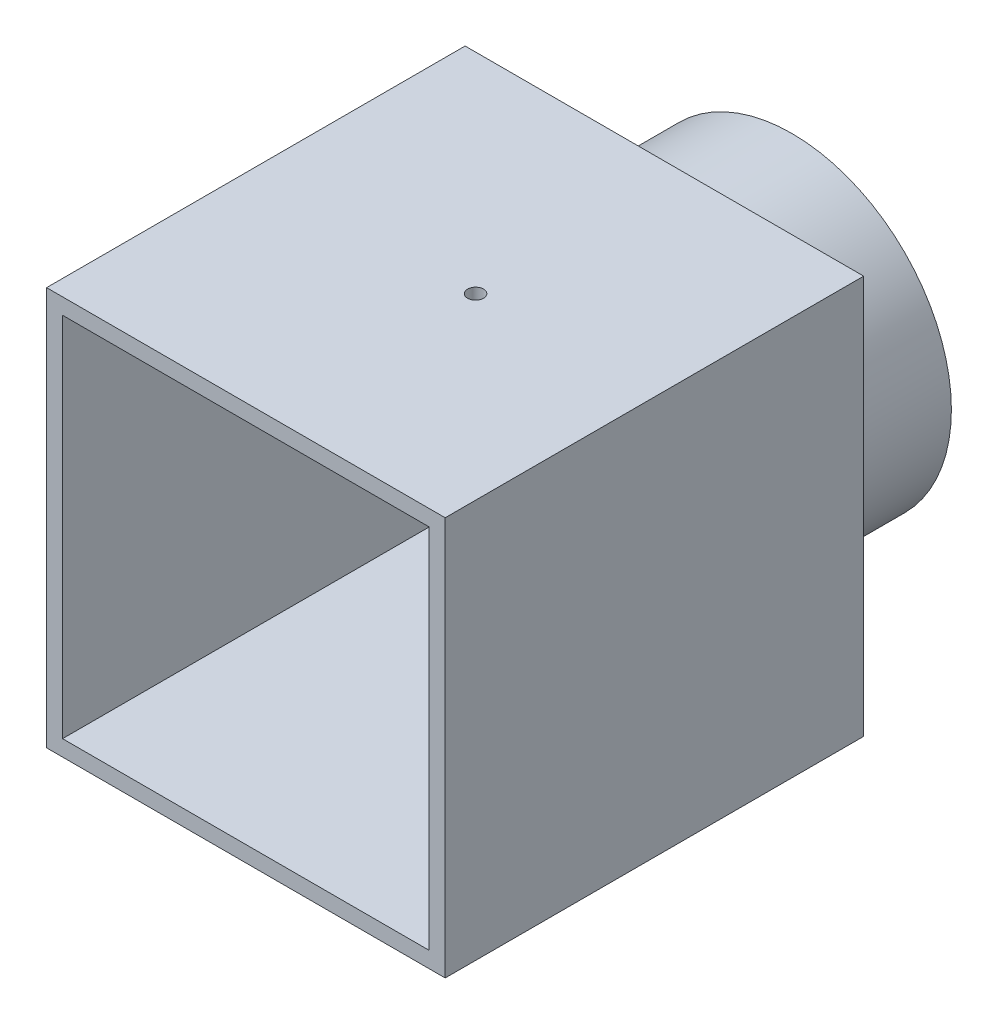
from build123d import *

# Parameters (mm, degrees)
ESQUISSE2_W             = 100
ESQUISSE2_H             = 100
ESQUISSE2_W_2           = 92
ESQUISSE2_H_2           = 92
BOSS_EXTRU_1_DEPTH      = 105
ESQUISSE3_W             = 92
ESQUISSE3_H             = 92
BOSS_EXTRU_2_DEPTH      = 4
ESQUISSE4_R             = 40
ESQUISSE4_R_2           = 36
BOSS_EXTRU_3_DEPTH      = 32
ESQUISSE5_R             = 2
ENL_V_MAT_EXTRU_1_DEPTH = 10


with BuildPart() as part:
    # Esquisse2 → Boss.-Extru.1 (new body)
    with BuildSketch(Plane.XY):
        Rectangle(ESQUISSE2_W, ESQUISSE2_H)
        Rectangle(ESQUISSE2_W_2, ESQUISSE2_H_2, mode=Mode.SUBTRACT)
    extrude(amount=BOSS_EXTRU_1_DEPTH)

    # Esquisse3 → Boss.-Extru.2 (add)
    with BuildSketch(Plane(origin=(0, 0, 0), x_dir=(-1, 0, 0), z_dir=(0, 0, -1))):
        Rectangle(ESQUISSE3_W, ESQUISSE3_H)
    extrude(amount=-BOSS_EXTRU_2_DEPTH)

    # Esquisse4 → Boss.-Extru.3 (add)
    with BuildSketch(Plane(origin=(0, 0, 0), x_dir=(-1, 0, 0), z_dir=(0, 0, -1))):
        with Locations(Location((0, 0, 0), (0, 0, 180))):
            Circle(ESQUISSE4_R)
        Circle(ESQUISSE4_R_2, mode=Mode.SUBTRACT)
    extrude(amount=BOSS_EXTRU_3_DEPTH)

    # Esquisse5 → Enl_v. mat.-Extru.1 (cut)
    with BuildSketch(Plane(origin=(0, 50, 0), x_dir=(1, 0, 0), z_dir=(0, 1, 0))):
        with Locations(Location((5.115500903, -52.5, 0), (0, 0, 270))):
            Circle(ESQUISSE5_R)
    extrude(amount=-ENL_V_MAT_EXTRU_1_DEPTH, mode=Mode.SUBTRACT)


solid = part.part
